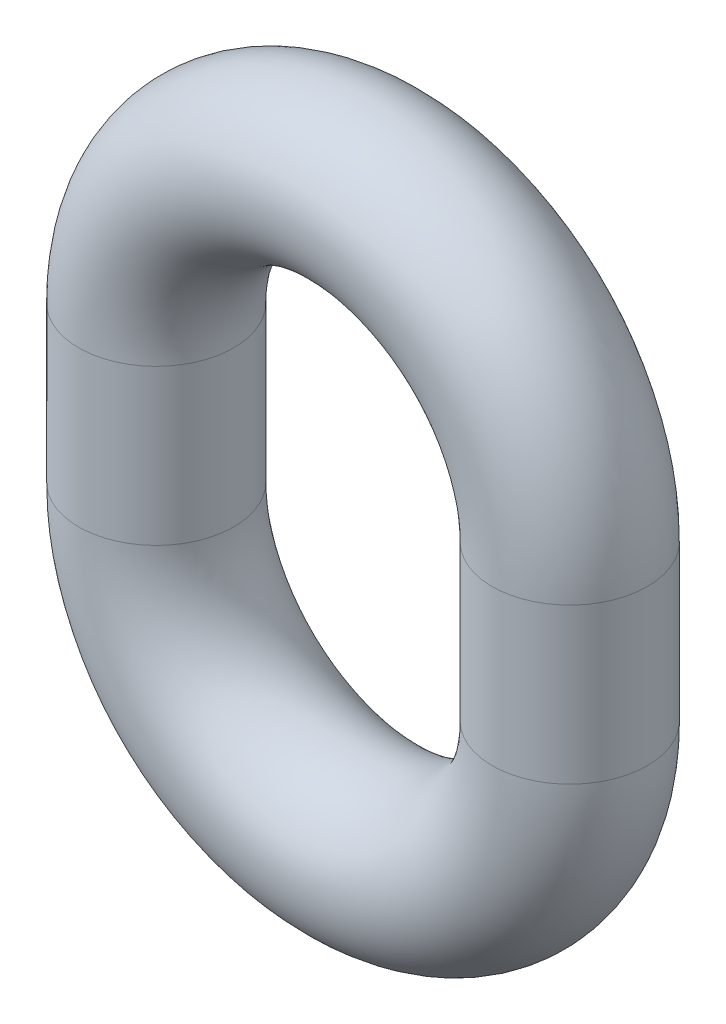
from build123d import *

# Parameters (mm, degrees)
ESQUISSE1_R = 9


with BuildPart() as part:
    # Base-Balayage: sweep along a path in Esquisse2
    with BuildLine(Plane.XY) as base_balayage_path:
        Line((24, 9), (24, -9))
        ThreePointArc((24, -9), (0, -33), (-24, -9))
        Line((-24, -9), (-24, 9))
        ThreePointArc((-24, 9), (0, 33), (24, 9))
    # Esquisse1 → Base-Balayage (sweep)
    with BuildSketch(Plane(origin=(0, 0, 0), x_dir=(1, 0, 0), z_dir=(0, 1, 0))):
        with Locations((24, 0)):
            Circle(ESQUISSE1_R)
    sweep(path=base_balayage_path.line)


solid = part.part
